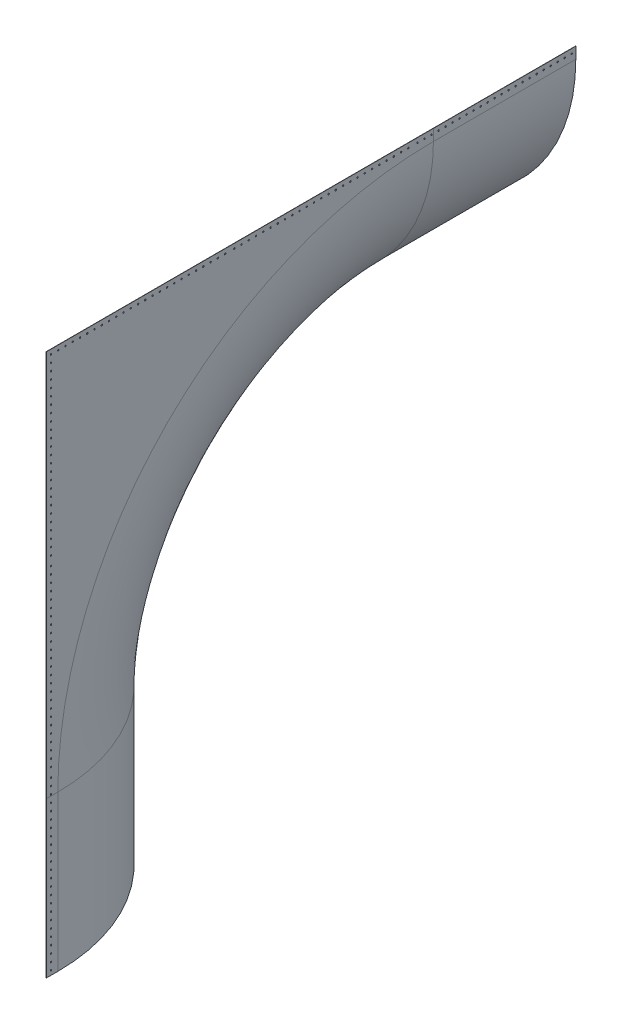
from build123d import *

# Parameters (mm, degrees)
BOSS_EXTRUDE1_DEPTH     = 920.7377971
BOSS_EXTRUDE2_START     = -1.5875
BOSS_EXTRUDE2_DEPTH     = 1.5875
BOSS_EXTRUDE3_START     = 1006.9599971
BOSS_EXTRUDE3_DEPTH     = 1006.9599971
SKETCH11_R              = 4.826
CUT_EXTRUDE1_DEPTH      = 10
SKETCH13_W              = 4401.129844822
SKETCH13_H              = 2946.111508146
CUT_EXTRUDE2_DEPTH      = 4621.611456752
CUT_EXTRUDE3_DEPTH      = 4621.611456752
CUT_EXTRUDE3_DEPTH_BACK = 4621.611456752


with BuildPart() as part:
    # Sweep2: sweep along a path in Corner Arch
    with BuildLine(Plane.YZ) as sweep2_path:
        Line((0, 0), (0, 75.7422029))
        ThreePointArc((0, 75.7422029), (-731.881575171, 1842.660627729), (-2498.8, 2574.5422029))
        Line((-2498.8, 2574.5422029), (-2574.5422029, 2574.5422029))
    # sk 48.2in rad pnl → Sweep2 (sweep)
    with BuildSketch(Plane(origin=(0, 0, 0), x_dir=(0, 1, 0), z_dir=(0, 0, 1))):
        with BuildLine():
            Line((0, -1222.6925), (75.746594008, -1222.6925))
            Line((75.746594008, -1222.6925), (75.746594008, -1224.28))
            Line((75.746594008, -1224.28), (0, -1224.28))
            ThreePointArc((0, -1224.28), (-865.696690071, -865.696690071), (-1224.28, 0))
            Line((-1224.28, 0), (-1224.28, 75.737811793))
            Line((-1224.28, 75.737811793), (-1222.6925, 75.737811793))
            Line((-1222.6925, 75.737811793), (-1222.6925, 0))
            ThreePointArc((-1222.6925, 0), (-864.574158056, -864.574158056), (0, -1222.6925))
        make_face()
    sweep(path=sweep2_path.line)

    # Lower profile → Boss-Extrude1 (add)
    with BuildSketch(Plane(origin=(0, 0, 0), x_dir=(1, 0, 0), z_dir=(0, 0, -1))):
        with BuildLine():
            Line((-75.737811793, 1224.28), (0, 1224.28))
            ThreePointArc((0, 1224.28), (865.696690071, 865.696690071), (1224.28, 0))
            Line((1224.28, 0), (1224.28, -75.746594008))
            Line((1224.28, -75.746594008), (1222.6925, -75.746594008))
            Line((1222.6925, -75.746594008), (1222.6925, 0))
            ThreePointArc((1222.6925, 0), (864.574158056, 864.574158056), (0, 1222.6925))
            Line((0, 1222.6925), (-75.737811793, 1222.6925))
            Line((-75.737811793, 1222.6925), (-75.737811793, 1224.28))
        make_face()
    extrude(amount=BOSS_EXTRUDE1_DEPTH)

    # Sketch9 → Boss-Extrude2 (add)
    with BuildSketch(Plane.YZ.offset(1224.28).offset(BOSS_EXTRUDE2_START)):
        with BuildLine():
            Line((75.746594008, 75.7422029), (75.746594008, 2650.288796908))
            Line((75.746594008, 2650.288796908), (-2498.8, 2650.288796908))
            ThreePointArc((-2498.8, 2650.288796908), (-678.320644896, 1896.221558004), (75.746594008, 75.7422029))
        make_face()
    extrude(amount=BOSS_EXTRUDE2_DEPTH)

    # Sketch12 → Boss-Extrude3 (add)
    with BuildSketch(Plane.XZ.offset(2574.5422029).offset(BOSS_EXTRUDE3_START)):
        with BuildLine():
            Line((1224.28, 2650.288796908), (1224.28, 2574.5422029))
            ThreePointArc((1224.28, 2574.5422029), (865.696690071, 1708.845512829), (0, 1350.2622029))
            Line((0, 1350.2622029), (-75.737811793, 1350.2622029))
            Line((-75.737811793, 1350.2622029), (-75.737811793, 1351.8497029))
            Line((-75.737811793, 1351.8497029), (0, 1351.8497029))
            ThreePointArc((0, 1351.8497029), (864.574158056, 1709.968044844), (1222.6925, 2574.5422029))
            Line((1222.6925, 2574.5422029), (1222.6925, 2650.288796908))
            Line((1222.6925, 2650.288796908), (1224.28, 2650.288796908))
        make_face()
    extrude(amount=-BOSS_EXTRUDE3_DEPTH)

    # Sketch11 → Cut-Extrude1 (cut)
    with BuildSketch(Plane.YZ.offset(1224.28)):
        with Locations(Location((45.444394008, -890.4355971, 0), (0, 0, 270))):
            Circle(SKETCH11_R)
        with Locations(Location((45.444394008, -843.8183971, 0), (0, 0, 270))):
            Circle(SKETCH11_R)
        with Locations(Location((45.444394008, -797.2011971, 0), (0, 0, 270))):
            Circle(SKETCH11_R)
        with Locations(Location((45.444394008, -750.5839971, 0), (0, 0, 270))):
            Circle(SKETCH11_R)
        with Locations(Location((45.444394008, -703.9667971, 0), (0, 0, 270))):
            Circle(SKETCH11_R)
        with Locations(Location((45.444394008, -657.3495971, 0), (0, 0, 270))):
            Circle(SKETCH11_R)
        with Locations(Location((45.444394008, -610.7323971, 0), (0, 0, 270))):
            Circle(SKETCH11_R)
        with Locations(Location((45.444394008, -564.1151971, 0), (0, 0, 270))):
            Circle(SKETCH11_R)
        with Locations(Location((45.444394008, -517.4979971, 0), (0, 0, 270))):
            Circle(SKETCH11_R)
        with Locations(Location((45.444394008, -470.8807971, 0), (0, 0, 270))):
            Circle(SKETCH11_R)
        with Locations(Location((45.444394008, -424.2635971, 0), (0, 0, 270))):
            Circle(SKETCH11_R)
        with Locations(Location((45.444394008, -377.6463971, 0), (0, 0, 270))):
            Circle(SKETCH11_R)
        with Locations(Location((45.444394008, -331.0291971, 0), (0, 0, 270))):
            Circle(SKETCH11_R)
        with Locations(Location((45.444394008, -284.4119971, 0), (0, 0, 270))):
            Circle(SKETCH11_R)
        with Locations(Location((45.444394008, -237.7947971, 0), (0, 0, 270))):
            Circle(SKETCH11_R)
        with Locations(Location((45.444394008, -191.1775971, 0), (0, 0, 270))):
            Circle(SKETCH11_R)
        with Locations(Location((45.444394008, -144.5603971, 0), (0, 0, 270))):
            Circle(SKETCH11_R)
        with Locations(Location((45.444394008, -97.9431971, 0), (0, 0, 270))):
            Circle(SKETCH11_R)
        with Locations(Location((45.444394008, -51.3259971, 0), (0, 0, 270))):
            Circle(SKETCH11_R)
        with Locations(Location((45.444394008, -4.7087971, 0), (0, 0, 270))):
            Circle(SKETCH11_R)
        with Locations(Location((45.444394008, 41.9084029, 0), (0, 0, 270))):
            Circle(SKETCH11_R)
        with Locations(Location((45.444394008, 88.5256029, 0), (0, 0, 270))):
            Circle(SKETCH11_R)
        with Locations(Location((45.444394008, 135.1428029, 0), (0, 0, 270))):
            Circle(SKETCH11_R)
        with Locations(Location((45.444394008, 181.7600029, 0), (0, 0, 270))):
            Circle(SKETCH11_R)
        with Locations(Location((45.444394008, 242.7200029, 0), (0, 0, 270))):
            Circle(SKETCH11_R)
        with Locations(Location((45.444394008, 290.9800029, 0), (0, 0, 270))):
            Circle(SKETCH11_R)
        with Locations(Location((45.444394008, 339.2400029, 0), (0, 0, 270))):
            Circle(SKETCH11_R)
        with Locations(Location((45.444394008, 387.5000029, 0), (0, 0, 270))):
            Circle(SKETCH11_R)
        with Locations(Location((45.444394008, 435.7600029, 0), (0, 0, 270))):
            Circle(SKETCH11_R)
        with Locations(Location((45.444394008, 484.0200029, 0), (0, 0, 270))):
            Circle(SKETCH11_R)
        with Locations(Location((45.444394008, 532.2800029, 0), (0, 0, 270))):
            Circle(SKETCH11_R)
        with Locations(Location((45.444394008, 580.5400029, 0), (0, 0, 270))):
            Circle(SKETCH11_R)
        with Locations(Location((45.444394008, 628.8000029, 0), (0, 0, 270))):
            Circle(SKETCH11_R)
        with Locations(Location((45.444394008, 677.0600029, 0), (0, 0, 270))):
            Circle(SKETCH11_R)
        with Locations(Location((45.444394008, 725.3200029, 0), (0, 0, 270))):
            Circle(SKETCH11_R)
        with Locations(Location((45.444394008, 773.5800029, 0), (0, 0, 270))):
            Circle(SKETCH11_R)
        with Locations(Location((45.444394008, 821.8400029, 0), (0, 0, 270))):
            Circle(SKETCH11_R)
        with Locations(Location((45.444394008, 870.1000029, 0), (0, 0, 270))):
            Circle(SKETCH11_R)
        with Locations(Location((45.444394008, 918.3600029, 0), (0, 0, 270))):
            Circle(SKETCH11_R)
        with Locations(Location((45.444394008, 966.6200029, 0), (0, 0, 270))):
            Circle(SKETCH11_R)
        with Locations(Location((45.444394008, 1014.8800029, 0), (0, 0, 270))):
            Circle(SKETCH11_R)
        with Locations(Location((45.444394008, 1063.1400029, 0), (0, 0, 270))):
            Circle(SKETCH11_R)
        with Locations(Location((45.444394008, 1111.4000029, 0), (0, 0, 270))):
            Circle(SKETCH11_R)
        with Locations(Location((45.444394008, 1159.6600029, 0), (0, 0, 270))):
            Circle(SKETCH11_R)
        with Locations(Location((45.444394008, 1207.9200029, 0), (0, 0, 270))):
            Circle(SKETCH11_R)
        with Locations(Location((45.444394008, 1256.1800029, 0), (0, 0, 270))):
            Circle(SKETCH11_R)
        with Locations(Location((45.444394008, 1304.4400029, 0), (0, 0, 270))):
            Circle(SKETCH11_R)
        with Locations(Location((45.444394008, 1352.7000029, 0), (0, 0, 270))):
            Circle(SKETCH11_R)
        with Locations(Location((45.444394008, 1400.9600029, 0), (0, 0, 270))):
            Circle(SKETCH11_R)
        with Locations(Location((45.444394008, 1461.7422029, 0), (0, 0, 270))):
            Circle(SKETCH11_R)
        with Locations(Location((45.444394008, 1510.0022029, 0), (0, 0, 270))):
            Circle(SKETCH11_R)
        with Locations(Location((45.444394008, 1558.2622029, 0), (0, 0, 270))):
            Circle(SKETCH11_R)
        with Locations(Location((45.444394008, 1606.5222029, 0), (0, 0, 270))):
            Circle(SKETCH11_R)
        with Locations(Location((45.444394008, 1654.7822029, 0), (0, 0, 270))):
            Circle(SKETCH11_R)
        with Locations(Location((45.444394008, 1703.0422029, 0), (0, 0, 270))):
            Circle(SKETCH11_R)
        with Locations(Location((45.444394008, 1751.3022029, 0), (0, 0, 270))):
            Circle(SKETCH11_R)
        with Locations(Location((45.444394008, 1799.5622029, 0), (0, 0, 270))):
            Circle(SKETCH11_R)
        with Locations(Location((45.444394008, 1847.8222029, 0), (0, 0, 270))):
            Circle(SKETCH11_R)
        with Locations(Location((45.444394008, 1896.0822029, 0), (0, 0, 270))):
            Circle(SKETCH11_R)
        with Locations(Location((45.444394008, 1944.3422029, 0), (0, 0, 270))):
            Circle(SKETCH11_R)
        with Locations(Location((45.444394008, 1992.6022029, 0), (0, 0, 270))):
            Circle(SKETCH11_R)
        with Locations(Location((45.444394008, 2040.8622029, 0), (0, 0, 270))):
            Circle(SKETCH11_R)
        with Locations(Location((45.444394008, 2089.1222029, 0), (0, 0, 270))):
            Circle(SKETCH11_R)
        with Locations(Location((45.444394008, 2137.3822029, 0), (0, 0, 270))):
            Circle(SKETCH11_R)
        with Locations(Location((45.444394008, 2185.6422029, 0), (0, 0, 270))):
            Circle(SKETCH11_R)
        with Locations(Location((45.444394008, 2233.9022029, 0), (0, 0, 270))):
            Circle(SKETCH11_R)
        with Locations(Location((45.444394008, 2282.1622029, 0), (0, 0, 270))):
            Circle(SKETCH11_R)
        with Locations(Location((45.444394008, 2330.4222029, 0), (0, 0, 270))):
            Circle(SKETCH11_R)
        with Locations(Location((45.444394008, 2378.6822029, 0), (0, 0, 270))):
            Circle(SKETCH11_R)
        with Locations(Location((45.444394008, 2426.9422029, 0), (0, 0, 270))):
            Circle(SKETCH11_R)
        with Locations(Location((45.444394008, 2475.2022029, 0), (0, 0, 270))):
            Circle(SKETCH11_R)
        with Locations(Location((45.444394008, 2523.4622029, 0), (0, 0, 270))):
            Circle(SKETCH11_R)
        with Locations(Location((45.444394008, 2571.7222029, 0), (0, 0, 270))):
            Circle(SKETCH11_R)
        with Locations(Location((45.444394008, 2619.9822029, 0), (0, 0, 270))):
            Circle(SKETCH11_R)
        with Locations(Location((-2.820000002, 2619.9822029, 0), (0, 0, 270))):
            Circle(SKETCH11_R)
        with Locations(Location((-51.080000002, 2619.9822029, 0), (0, 0, 270))):
            Circle(SKETCH11_R)
        with Locations(Location((-99.340000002, 2619.9822029, 0), (0, 0, 270))):
            Circle(SKETCH11_R)
        with Locations(Location((-147.600000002, 2619.9822029, 0), (0, 0, 270))):
            Circle(SKETCH11_R)
        with Locations(Location((-195.860000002, 2619.9822029, 0), (0, 0, 270))):
            Circle(SKETCH11_R)
        with Locations(Location((-244.120000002, 2619.9822029, 0), (0, 0, 270))):
            Circle(SKETCH11_R)
        with Locations(Location((-292.380000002, 2619.9822029, 0), (0, 0, 270))):
            Circle(SKETCH11_R)
        with Locations(Location((-340.640000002, 2619.9822029, 0), (0, 0, 270))):
            Circle(SKETCH11_R)
        with Locations(Location((-388.900000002, 2619.9822029, 0), (0, 0, 270))):
            Circle(SKETCH11_R)
        with Locations(Location((-437.160000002, 2619.9822029, 0), (0, 0, 270))):
            Circle(SKETCH11_R)
        with Locations(Location((-485.420000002, 2619.9822029, 0), (0, 0, 270))):
            Circle(SKETCH11_R)
        with Locations(Location((-533.680000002, 2619.9822029, 0), (0, 0, 270))):
            Circle(SKETCH11_R)
        with Locations(Location((-581.940000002, 2619.9822029, 0), (0, 0, 270))):
            Circle(SKETCH11_R)
        with Locations(Location((-630.200000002, 2619.9822029, 0), (0, 0, 270))):
            Circle(SKETCH11_R)
        with Locations(Location((-678.460000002, 2619.9822029, 0), (0, 0, 270))):
            Circle(SKETCH11_R)
        with Locations(Location((-726.720000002, 2619.9822029, 0), (0, 0, 270))):
            Circle(SKETCH11_R)
        with Locations(Location((-774.980000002, 2619.9822029, 0), (0, 0, 270))):
            Circle(SKETCH11_R)
        with Locations(Location((-823.240000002, 2619.9822029, 0), (0, 0, 270))):
            Circle(SKETCH11_R)
        with Locations(Location((-871.500000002, 2619.9822029, 0), (0, 0, 270))):
            Circle(SKETCH11_R)
        with Locations(Location((-919.760000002, 2619.9822029, 0), (0, 0, 270))):
            Circle(SKETCH11_R)
        with Locations(Location((-968.020000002, 2619.9822029, 0), (0, 0, 270))):
            Circle(SKETCH11_R)
        with Locations(Location((-1016.280000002, 2619.9822029, 0), (0, 0, 270))):
            Circle(SKETCH11_R)
        with Locations(Location((-1064.540000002, 2619.9822029, 0), (0, 0, 270))):
            Circle(SKETCH11_R)
        with Locations(Location((-1112.800000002, 2619.9822029, 0), (0, 0, 270))):
            Circle(SKETCH11_R)
        with Locations(Location((-1173.760000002, 2619.9822029, 0), (0, 0, 270))):
            Circle(SKETCH11_R)
        with Locations(Location((-1222.020000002, 2619.9822029, 0), (0, 0, 270))):
            Circle(SKETCH11_R)
        with Locations(Location((-1270.280000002, 2619.9822029, 0), (0, 0, 270))):
            Circle(SKETCH11_R)
        with Locations(Location((-1318.540000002, 2619.9822029, 0), (0, 0, 270))):
            Circle(SKETCH11_R)
        with Locations(Location((-1366.800000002, 2619.9822029, 0), (0, 0, 270))):
            Circle(SKETCH11_R)
        with Locations(Location((-1415.060000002, 2619.9822029, 0), (0, 0, 270))):
            Circle(SKETCH11_R)
        with Locations(Location((-1463.320000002, 2619.9822029, 0), (0, 0, 270))):
            Circle(SKETCH11_R)
        with Locations(Location((-1511.580000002, 2619.9822029, 0), (0, 0, 270))):
            Circle(SKETCH11_R)
        with Locations(Location((-1559.840000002, 2619.9822029, 0), (0, 0, 270))):
            Circle(SKETCH11_R)
        with Locations(Location((-1608.100000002, 2619.9822029, 0), (0, 0, 270))):
            Circle(SKETCH11_R)
        with Locations(Location((-1656.360000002, 2619.9822029, 0), (0, 0, 270))):
            Circle(SKETCH11_R)
        with Locations(Location((-1704.620000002, 2619.9822029, 0), (0, 0, 270))):
            Circle(SKETCH11_R)
        with Locations(Location((-1752.880000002, 2619.9822029, 0), (0, 0, 270))):
            Circle(SKETCH11_R)
        with Locations(Location((-1801.140000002, 2619.9822029, 0), (0, 0, 270))):
            Circle(SKETCH11_R)
        with Locations(Location((-1849.400000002, 2619.9822029, 0), (0, 0, 270))):
            Circle(SKETCH11_R)
        with Locations(Location((-1897.660000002, 2619.9822029, 0), (0, 0, 270))):
            Circle(SKETCH11_R)
        with Locations(Location((-1945.920000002, 2619.9822029, 0), (0, 0, 270))):
            Circle(SKETCH11_R)
        with Locations(Location((-1994.180000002, 2619.9822029, 0), (0, 0, 270))):
            Circle(SKETCH11_R)
        with Locations(Location((-2042.440000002, 2619.9822029, 0), (0, 0, 270))):
            Circle(SKETCH11_R)
        with Locations(Location((-2090.700000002, 2619.9822029, 0), (0, 0, 270))):
            Circle(SKETCH11_R)
        with Locations(Location((-2138.960000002, 2619.9822029, 0), (0, 0, 270))):
            Circle(SKETCH11_R)
        with Locations(Location((-2187.220000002, 2619.9822029, 0), (0, 0, 270))):
            Circle(SKETCH11_R)
        with Locations(Location((-2235.480000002, 2619.9822029, 0), (0, 0, 270))):
            Circle(SKETCH11_R)
        with Locations(Location((-2283.740000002, 2619.9822029, 0), (0, 0, 270))):
            Circle(SKETCH11_R)
        with Locations(Location((-2332.000000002, 2619.9822029, 0), (0, 0, 270))):
            Circle(SKETCH11_R)
        with Locations(Location((-2392.960000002, 2619.9822029, 0), (0, 0, 270))):
            Circle(SKETCH11_R)
        with Locations(Location((-2441.220000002, 2619.9822029, 0), (0, 0, 270))):
            Circle(SKETCH11_R)
        with Locations(Location((-2489.480000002, 2619.9822029, 0), (0, 0, 270))):
            Circle(SKETCH11_R)
        with Locations(Location((-2537.740000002, 2619.9822029, 0), (0, 0, 270))):
            Circle(SKETCH11_R)
        with Locations(Location((-2586.000000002, 2619.9822029, 0), (0, 0, 270))):
            Circle(SKETCH11_R)
        with Locations(Location((-2634.260000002, 2619.9822029, 0), (0, 0, 270))):
            Circle(SKETCH11_R)
        with Locations(Location((-2682.520000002, 2619.9822029, 0), (0, 0, 270))):
            Circle(SKETCH11_R)
        with Locations(Location((-2730.780000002, 2619.9822029, 0), (0, 0, 270))):
            Circle(SKETCH11_R)
        with Locations(Location((-2779.040000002, 2619.9822029, 0), (0, 0, 270))):
            Circle(SKETCH11_R)
        with Locations(Location((-2827.300000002, 2619.9822029, 0), (0, 0, 270))):
            Circle(SKETCH11_R)
        with Locations(Location((-2875.560000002, 2619.9822029, 0), (0, 0, 270))):
            Circle(SKETCH11_R)
        with Locations(Location((-2923.820000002, 2619.9822029, 0), (0, 0, 270))):
            Circle(SKETCH11_R)
        with Locations(Location((-2972.080000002, 2619.9822029, 0), (0, 0, 270))):
            Circle(SKETCH11_R)
        with Locations(Location((-3020.340000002, 2619.9822029, 0), (0, 0, 270))):
            Circle(SKETCH11_R)
        with Locations(Location((-3068.600000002, 2619.9822029, 0), (0, 0, 270))):
            Circle(SKETCH11_R)
        with Locations(Location((-3116.860000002, 2619.9822029, 0), (0, 0, 270))):
            Circle(SKETCH11_R)
        with Locations(Location((-3165.120000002, 2619.9822029, 0), (0, 0, 270))):
            Circle(SKETCH11_R)
        with Locations(Location((-3213.380000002, 2619.9822029, 0), (0, 0, 270))):
            Circle(SKETCH11_R)
        with Locations(Location((-3261.640000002, 2619.9822029, 0), (0, 0, 270))):
            Circle(SKETCH11_R)
        with Locations(Location((-3309.900000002, 2619.9822029, 0), (0, 0, 270))):
            Circle(SKETCH11_R)
        with Locations(Location((-3358.160000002, 2619.9822029, 0), (0, 0, 270))):
            Circle(SKETCH11_R)
        with Locations(Location((-3406.420000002, 2619.9822029, 0), (0, 0, 270))):
            Circle(SKETCH11_R)
        with Locations(Location((-3454.680000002, 2619.9822029, 0), (0, 0, 270))):
            Circle(SKETCH11_R)
        with Locations(Location((-3502.940000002, 2619.9822029, 0), (0, 0, 270))):
            Circle(SKETCH11_R)
        with Locations(Location((-3551.200000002, 2619.9822029, 0), (0, 0, 270))):
            Circle(SKETCH11_R)
    extrude(amount=-CUT_EXTRUDE1_DEPTH, mode=Mode.SUBTRACT)

    # Sketch13 → Cut-Extrude2 (cut, through all)
    with BuildSketch(Plane.YZ):
        with Locations((-1891.164669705, 365.740285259)):
            Rectangle(SKETCH13_W, SKETCH13_H)
    extrude(amount=-CUT_EXTRUDE2_DEPTH, mode=Mode.SUBTRACT)

    # Sketch14 → Cut-Extrude3 (cut, two sides: drawn at the far end of the back side and taken through both)
    with BuildSketch(Plane.YZ.offset(-CUT_EXTRUDE3_DEPTH_BACK)):
        Polygon((-3958.436958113, 2838.149337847), (-3532.15, 2838.149337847), (-3532.15, -871.3855971), (231.615542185, -871.3855971), (231.615542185, -1092.657395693), (-3958.436958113, -1092.657395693), align=None)
    extrude(amount=CUT_EXTRUDE3_DEPTH + CUT_EXTRUDE3_DEPTH_BACK, mode=Mode.SUBTRACT)


solid = part.part
